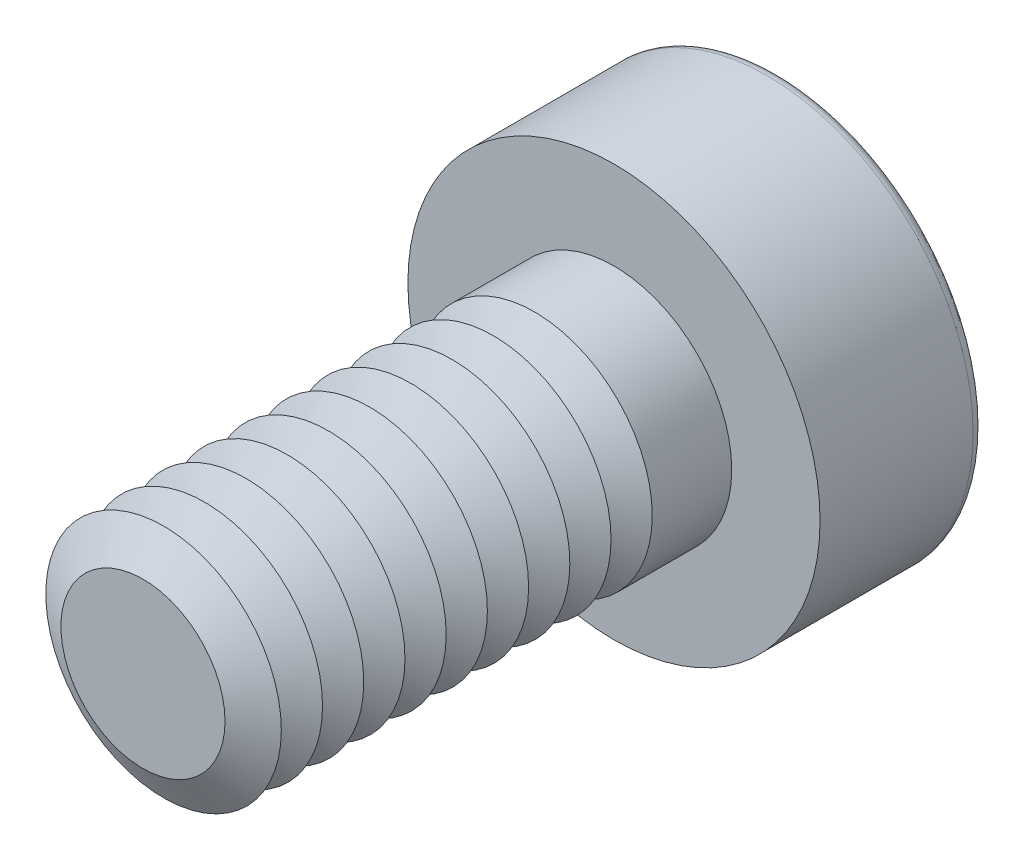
from build123d import *

# Parameters (mm, degrees)
SKETCH1_R           = 2
BOSS_EXTRUDE1_DEPTH = 8
SKETCH2_R           = 3.5
BOSS_EXTRUDE2_DEPTH = 2.8
CUT_EXTRUDE1_DEPTH  = 1.875
FILLET1_R           = 0.2
LPATTERN1_COUNT     = 10
LPATTERN1_PITCH     = 0.7


with BuildPart() as part:
    # Sketch1 → Boss-Extrude1 (new body)
    with BuildSketch(Plane.XY):
        Circle(SKETCH1_R)
    extrude(amount=BOSS_EXTRUDE1_DEPTH)

    # Sketch2 → Boss-Extrude2 (add)
    with BuildSketch(Plane(origin=(0, 0, 0), x_dir=(-1, 0, 0), z_dir=(0, 0, -1))):
        Circle(SKETCH2_R)
    extrude(amount=BOSS_EXTRUDE2_DEPTH)

    # Sketch3 → Cut-Extrude1 (cut)
    with BuildSketch(Plane(origin=(0, 0, -2.8), x_dir=(-1, 0, 0), z_dir=(0, 0, -1))):
        Polygon((-0.721687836, 1.25), (-1.443375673, 0), (-0.721687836, -1.25), (0.721687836, -1.25), (1.443375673, 0), (0.721687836, 1.25), align=None)
    extrude(amount=-CUT_EXTRUDE1_DEPTH, mode=Mode.SUBTRACT)

    # Fillet1
    fillet1_edges = [part.edges().sort_by_distance(p)[0] for p in [
        (3.5, 0, -2.8),
    ]]
    fillet(fillet1_edges, radius=FILLET1_R)

    # Cut-Extrude2 cone 1 section (on through the dimple's axis) → Cut-Extrude2 (revolve, cut)
    with BuildSketch(Plane(origin=(0, 0, -0.925), x_dir=(0, 1, 0), z_dir=(1, 0, 0))):
        Polygon((0, 0), (1.25, 0), (0, 0.721687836), align=None)
    revolve(axis=Axis((0, 0, -0.925), (0, 0, 1)), mode=Mode.SUBTRACT)

    # Cut-Extrude3 cone 1 section (on through the dimple's axis) → Cut-Extrude3 (revolve, cut)
    with BuildSketch(Plane(origin=(0, 0, -2.8), x_dir=(0, 1, 0), z_dir=(1, 0, 0))):
        Polygon((0, 0), (1.443375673, 0), (0, 0.386751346), align=None)
    revolve(axis=Axis((0, 0, -2.8), (0, 0, 1)), mode=Mode.SUBTRACT)

    # Sketch7 → Cut-Revolve1 (revolve, cut)
    with BuildSketch(Plane(origin=(0, 0, 0), x_dir=(0, 0, -1), z_dir=(1, 0, 0)), mode=Mode.PRIVATE) as cut_revolve1_sk:
        Polygon((-8, 1.393782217), (-7.65, 2), (-8.35, 2), align=None)
    cut_revolve1 = revolve(cut_revolve1_sk.sketch.rotate(Axis((0, 0, 8), (0, 0, -1)), 90), axis=Axis((0, 0, 8), (0, 0, -1)), mode=Mode.SUBTRACT)

    # LPattern1: Cut-Revolve1 ×10
    with Locations(*[(0, 0, -i * LPATTERN1_PITCH) for i in range(1, LPATTERN1_COUNT)]):
        add(cut_revolve1, mode=Mode.SUBTRACT)


solid = part.part
